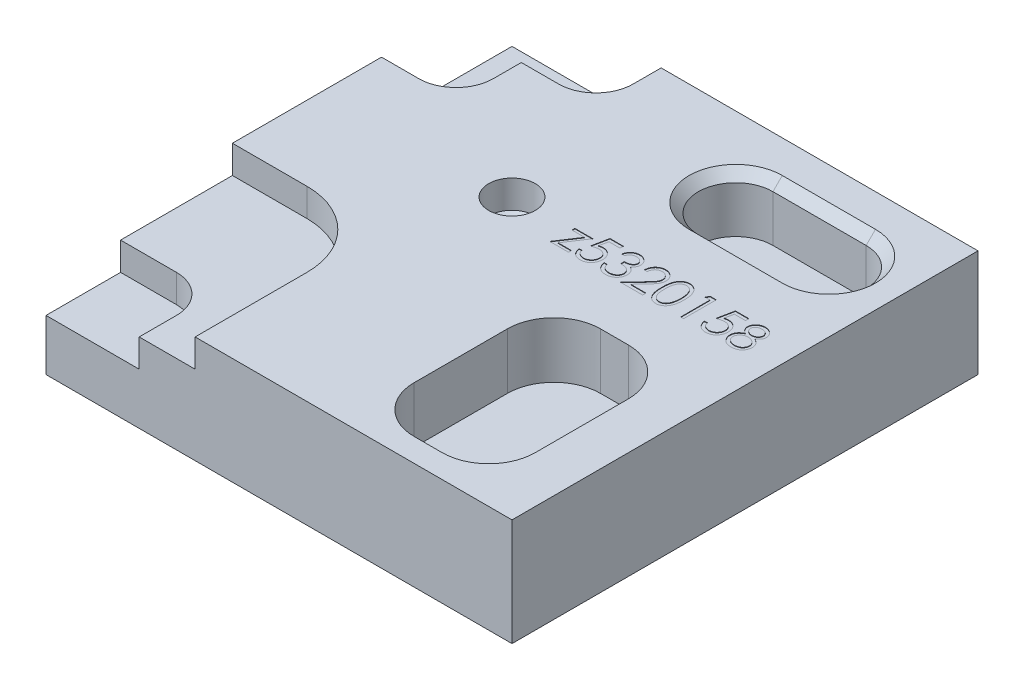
from build123d import *

# Parameters (mm, degrees)
SKETCH1_W                       = 50
SKETCH1_H                       = 50
BOSS_EXTRUDE1_DEPTH             = 11.5
CUT_EXTRUDE1_DEPTH              = 3
CUT_EXTRUDE4_DEPTH              = 43.99702731
CUT_EXTRUDE4_DEPTH_BACK         = 3
CUT_EXTRUDE5_DEPTH              = 6
CUT_EXTRUDE8_DEPTH              = 6
CUT_EXTRUDE11_DEPTH             = 44.689178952
CUT_EXTRUDE11_DEPTH_BACK        = 6
CHAMFER1_SIZE                   = 1
F_3_0MM_DOWEL_HOLE1_D           = 3
F_3_0MM_DOWEL_HOLE1_DEPTH       = 6
F_3_0MM_DOWEL_HOLE1_CSINK_D     = 3.05
F_3_0MM_DOWEL_HOLE1_CSINK_ANGLE = 90
F_3_0MM_DOWEL_HOLE1_TIP         = 0.901290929
F_5_0MM_DOWEL_HOLE1_D           = 5
F_5_0MM_DOWEL_HOLE1_DEPTH       = 3
F_5_0MM_DOWEL_HOLE1_TIP         = 1.502151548
ENGRAVE_CUT_DEPTH               = 0.05


with BuildPart() as part:
    # Sketch1 → Boss-Extrude1 (new body)
    with BuildSketch(Plane(origin=(0, 0, 0), x_dir=(1, 0, 0), z_dir=(0, 1, 0))):
        with Locations((4.357016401, -5.243345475)):
            Rectangle(SKETCH1_W, SKETCH1_H)
    extrude(amount=BOSS_EXTRUDE1_DEPTH)

    # Sketch3 → Cut-Extrude1 (cut)
    with BuildSketch(Plane(origin=(0, 11.5, 0), x_dir=(1, 0, 0), z_dir=(0, 1, 0))):
        with BuildLine():
            Line((-20.642983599, -10.243345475), (-12.642983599, -10.243345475))
            ThreePointArc((-12.642983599, -10.243345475), (-6.986129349, -12.586491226), (-4.642983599, -18.243345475))
            Line((-4.642983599, -18.243345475), (-4.642983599, -30.243345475))
            Line((-4.642983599, -30.243345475), (-20.642983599, -30.243345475))
            Line((-20.642983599, -30.243345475), (-20.642983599, -10.243345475))
        make_face()
    extrude(amount=-CUT_EXTRUDE1_DEPTH, mode=Mode.SUBTRACT)

    # Sketch7 → Cut-Extrude4 (cut, two sides: drawn at the far end of the back side and taken through both)
    with BuildSketch(Plane(origin=(0, 8.5, 0), x_dir=(1, 0, 0), z_dir=(0, 1, 0)).offset(-CUT_EXTRUDE4_DEPTH_BACK)):
        with BuildLine():
            Line((-161.241605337, -22.243345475), (-20.642983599, -22.243345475))
            Line((-20.642983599, -22.243345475), (-14.642983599, -22.243345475))
            ThreePointArc((-14.642983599, -22.243345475), (-11.814556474, -23.41491835), (-10.642983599, -26.243345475))
            Line((-10.642983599, -26.243345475), (-10.642983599, -30.243345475))
            Line((-10.642983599, -30.243345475), (-10.642983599, -170.841967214))
            Line((-10.642983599, -170.841967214), (-208.145915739, -371.003106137))
            Line((-208.145915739, -371.003106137), (-358.744537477, -222.404484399))
            Line((-358.744537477, -222.404484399), (-161.241605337, -22.243345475))
        make_face()
    extrude(amount=CUT_EXTRUDE4_DEPTH + CUT_EXTRUDE4_DEPTH_BACK, mode=Mode.SUBTRACT)

    # Sketch8 → Cut-Extrude5 (cut)
    with BuildSketch(Plane(origin=(0, 11.5, 0), x_dir=(1, 0, 0), z_dir=(0, 1, 0))):
        with BuildLine():
            Line((16.357016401, -7.743345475), (19.357016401, -7.743345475))
            ThreePointArc((19.357016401, -7.743345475), (22.892550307, -9.207811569), (24.357016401, -12.743345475))
            Line((24.357016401, -12.743345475), (24.357016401, -22.743345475))
            ThreePointArc((24.357016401, -22.743345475), (22.892550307, -26.278879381), (19.357016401, -27.743345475))
            Line((19.357016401, -27.743345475), (16.357016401, -27.743345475))
            ThreePointArc((16.357016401, -27.743345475), (12.821482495, -26.278879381), (11.357016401, -22.743345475))
            Line((11.357016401, -22.743345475), (11.357016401, -12.743345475))
            ThreePointArc((11.357016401, -12.743345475), (12.821482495, -9.207811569), (16.357016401, -7.743345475))
        make_face()
    extrude(amount=-CUT_EXTRUDE5_DEPTH, mode=Mode.SUBTRACT)

    # Sketch11 → Cut-Extrude8 (cut)
    with BuildSketch(Plane(origin=(0, 11.5, 0), x_dir=(1, 0, 0), z_dir=(0, 1, 0))):
        with BuildLine():
            Line((11.857016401, 15.256654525), (21.857016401, 15.256654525))
            ThreePointArc((21.857016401, 15.256654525), (25.857016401, 11.256654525), (21.857016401, 7.256654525))
            Line((21.857016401, 7.256654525), (11.857016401, 7.256654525))
            ThreePointArc((11.857016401, 7.256654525), (7.857016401, 11.256654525), (11.857016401, 15.256654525))
        make_face()
    extrude(amount=-CUT_EXTRUDE8_DEPTH, mode=Mode.SUBTRACT)

    # Sketch12 → Cut-Extrude11 (cut, two sides: drawn at the far end of the back side and taken through both)
    with BuildSketch(Plane(origin=(0, 11.5, 0), x_dir=(1, 0, 0), z_dir=(0, 1, 0)).offset(-CUT_EXTRUDE11_DEPTH_BACK)):
        with BuildLine():
            Line((-153.866358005, 5.756654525), (-20.642983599, 5.756654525))
            Line((-20.642983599, 5.756654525), (-16.642983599, 5.756654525))
            ThreePointArc((-16.642983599, 5.756654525), (-13.814556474, 6.9282274), (-12.642983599, 9.756654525))
            Line((-12.642983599, 9.756654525), (-12.642983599, 12.756654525))
            Line((-12.642983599, 12.756654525), (-8.642983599, 12.756654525))
            ThreePointArc((-8.642983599, 12.756654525), (-5.814556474, 13.9282274), (-4.642983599, 16.756654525))
            Line((-4.642983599, 16.756654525), (-4.642983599, 19.756654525))
            Line((-4.642983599, 19.756654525), (-4.642983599, 152.980028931))
            Line((-4.642983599, 152.980028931), (-191.773930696, 342.653112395))
            Line((-191.773930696, 342.653112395), (-340.997305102, 195.429737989))
            Line((-340.997305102, 195.429737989), (-153.866358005, 5.756654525))
        make_face()
    extrude(amount=CUT_EXTRUDE11_DEPTH + CUT_EXTRUDE11_DEPTH_BACK, mode=Mode.SUBTRACT)

    # Chamfer1
    chamfer1_edges = [part.edges().sort_by_distance(p)[0] for p in [
        (7.857016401, 11.5, -11.256654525),
        (16.857016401, 11.5, -7.256654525),
        (25.857016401, 11.5, -11.256654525),
        (16.857016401, 11.5, -15.256654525),
    ]]
    chamfer(chamfer1_edges, length=CHAMFER1_SIZE)

    # 3.0mm Dowel Hole1
    with Locations(Plane(origin=(-0.642983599, 11.5, 0.243345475), x_dir=(0, 0, 1), z_dir=(0, 1, 0))):
        with Locations((0, 0)):
            CounterSinkHole(F_3_0MM_DOWEL_HOLE1_D / 2, F_3_0MM_DOWEL_HOLE1_CSINK_D / 2, depth=F_3_0MM_DOWEL_HOLE1_DEPTH, counter_sink_angle=F_3_0MM_DOWEL_HOLE1_CSINK_ANGLE)
            with Locations((0, 0, -(F_3_0MM_DOWEL_HOLE1_DEPTH + F_3_0MM_DOWEL_HOLE1_TIP / 2))):  # 118° drill point
                Cone(0, F_3_0MM_DOWEL_HOLE1_D / 2, F_3_0MM_DOWEL_HOLE1_TIP, mode=Mode.SUBTRACT)

    # 5.0mm Dowel Hole1
    with Locations(Plane(origin=(-0.642983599, 11.5, 0.243345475), x_dir=(0, 0, 1), z_dir=(0, 1, 0))):
        with Locations((0, 0)):
            Hole(F_5_0MM_DOWEL_HOLE1_D / 2, depth=F_5_0MM_DOWEL_HOLE1_DEPTH)
            with Locations((0, 0, -(F_5_0MM_DOWEL_HOLE1_DEPTH + F_5_0MM_DOWEL_HOLE1_TIP / 2))):  # 118° drill point
                Cone(0, F_5_0MM_DOWEL_HOLE1_D / 2, F_5_0MM_DOWEL_HOLE1_TIP, mode=Mode.SUBTRACT)

    # Engrave → Engrave cut (cut)
    # profile 1 of 8: a face of its own
    with BuildSketch(Plane(origin=(0, 11.5, 0), x_dir=(1, 0, 0), z_dir=(0, 1, 0))):
        Polygon((5.641411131, 0.217706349), (7.570898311, 0.217706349), (6.083117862, -2.025883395), (7.526026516, -2.025883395), (7.526026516, -2.339985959), (5.506795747, -2.339985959), (6.995277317, -0.096396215), (5.641411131, -0.096396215), align=None)
    # profile 2 of 8: a face of its own
    with BuildSketch(Plane(origin=(0, 11.5, 0), x_dir=(1, 0, 0), z_dir=(0, 1, 0))):
        with BuildLine():
            Line((9.904231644, 1.160014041), (9.904231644, 0.801039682))
            Line((9.904231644, 0.801039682), (8.713726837, 0.801039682))
            Line((8.713726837, 0.801039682), (8.525125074, -0.119533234))
            add(Edge.make_bspline(
                [(8.525125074, -0.119533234), (8.562180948, -0.109302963), (8.633970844, -0.089483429), (8.739930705, -0.067477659), (8.840522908, -0.054212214), (8.905798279, -0.052400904), (8.937384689, -0.05152442)],
                knots=[0, 0, 0, 0, 1.100273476, 2.13160584, 3.095893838, 4, 4, 4, 4], degree=3))
            add(Edge.make_bspline(
                [(8.937384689, -0.05152442), (8.976468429, -0.052370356), (9.053316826, -0.054033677), (9.165755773, -0.070005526), (9.273088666, -0.095145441), (9.375091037, -0.130265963), (9.471951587, -0.175175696), (9.562779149, -0.231275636), (9.648937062, -0.296808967), (9.728879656, -0.372153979), (9.801403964, -0.455075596), (9.865169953, -0.544233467), (9.919332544, -0.638761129), (9.962893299, -0.739561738), (9.997677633, -0.845520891), (10.020829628, -0.957753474), (10.036246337, -1.075201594), (10.037968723, -1.155506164), (10.038847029, -1.196456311)],
                knots=[0, 0, 0, 0, 1.052922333, 2.070308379, 3.05430497, 4.020497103, 4.973039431, 5.925935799, 6.892292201, 7.88610001, 8.88166317, 9.857072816, 10.836096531, 11.812156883, 12.81219415, 13.836441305, 14.89672472, 16, 16, 16, 16], degree=3))
            add(Edge.make_bspline(
                [(10.038847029, -1.196456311), (10.038181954, -1.224978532), (10.036860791, -1.281637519), (10.030142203, -1.36578172), (10.017206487, -1.448144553), (9.999838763, -1.528736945), (9.977296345, -1.607406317), (9.950007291, -1.684377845), (9.916611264, -1.759172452), (9.879979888, -1.832497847), (9.83873341, -1.902696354), (9.792954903, -1.96834534), (9.744589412, -2.030429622), (9.692548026, -2.088283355), (9.636347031, -2.141526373), (9.576667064, -2.190474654), (9.513984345, -2.235955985), (9.447329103, -2.27612418), (9.37818662, -2.313087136), (9.305558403, -2.343410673), (9.231097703, -2.370521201), (9.153732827, -2.392130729), (9.073639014, -2.409063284), (8.990684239, -2.420563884), (8.905303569, -2.428940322), (8.847428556, -2.429464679), (8.818193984, -2.429729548)],
                knots=[0, 0, 0, 0, 1.056347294, 2.098418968, 3.122841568, 4.141288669, 5.149314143, 6.15115421, 7.162517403, 8.180376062, 9.185164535, 10.17417709, 11.141909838, 12.097768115, 13.052685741, 14.0056014, 14.954263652, 15.917497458, 16.885230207, 17.854509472, 18.828990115, 19.81800267, 20.826176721, 21.857883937, 22.917946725, 24, 24, 24, 24], degree=3))
            add(Edge.make_bspline(
                [(8.818193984, -2.429729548), (8.783319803, -2.429038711), (8.714708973, -2.427679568), (8.614188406, -2.413461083), (8.5174738, -2.393097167), (8.425343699, -2.362460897), (8.336972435, -2.324073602), (8.253549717, -2.275557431), (8.172943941, -2.220578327), (8.098431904, -2.155697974), (8.029275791, -2.084782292), (7.967369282, -2.007824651), (7.912235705, -1.926095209), (7.864757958, -1.839197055), (7.824259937, -1.747358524), (7.792444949, -1.650235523), (7.766766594, -1.548335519), (7.755903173, -1.478182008), (7.75038549, -1.442550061)],
                knots=[0, 0, 0, 0, 1.0467383, 2.05933395, 3.04377827, 4.011590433, 4.970194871, 5.932262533, 6.905835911, 7.896367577, 8.894135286, 9.877477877, 10.858688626, 11.851381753, 12.8477658, 13.868841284, 14.917554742, 16, 16, 16, 16], degree=3))
            Line((7.75038549, -1.442550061), (8.064488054, -1.442550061))
            add(Edge.make_bspline(
                [(8.064488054, -1.442550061), (8.072216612, -1.475926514), (8.087071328, -1.540077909), (8.119677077, -1.63020925), (8.159542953, -1.710528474), (8.206947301, -1.782098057), (8.263497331, -1.844507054), (8.32802676, -1.900124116), (8.400374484, -1.950299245), (8.480767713, -1.992122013), (8.565580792, -2.027790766), (8.654348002, -2.051542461), (8.744652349, -2.068243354), (8.805730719, -2.069915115), (8.836423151, -2.07075519)],
                knots=[0, 0, 0, 0, 1.136247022, 2.183929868, 3.172523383, 4.106158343, 5.02341133, 5.958108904, 6.928429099, 7.938127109, 8.96079061, 9.975095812, 10.982467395, 12, 12, 12, 12], degree=3))
            add(Edge.make_bspline(
                [(8.836423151, -2.07075519), (8.866381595, -2.069934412), (8.925370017, -2.068318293), (9.012181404, -2.055879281), (9.095994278, -2.03672171), (9.175981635, -2.008051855), (9.253543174, -1.973207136), (9.326716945, -1.928492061), (9.397619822, -1.877032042), (9.464047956, -1.818075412), (9.524887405, -1.753105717), (9.578643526, -1.683628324), (9.623420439, -1.609511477), (9.661154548, -1.532038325), (9.689807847, -1.450359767), (9.710248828, -1.364858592), (9.722251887, -1.275323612), (9.723903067, -1.214254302), (9.724744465, -1.183134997)],
                knots=[0, 0, 0, 0, 1.027316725, 2.022795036, 3.002884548, 3.971462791, 4.93288096, 5.914575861, 6.907176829, 7.935150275, 8.956128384, 9.956726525, 10.942570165, 11.921478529, 12.907843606, 13.90538589, 14.932640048, 16, 16, 16, 16], degree=3))
            add(Edge.make_bspline(
                [(9.724744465, -1.183134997), (9.724085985, -1.155059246), (9.722797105, -1.100104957), (9.712266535, -1.01970575), (9.693949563, -0.943632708), (9.668525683, -0.871518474), (9.636246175, -0.803295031), (9.596799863, -0.738891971), (9.549446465, -0.679158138), (9.495354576, -0.624065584), (9.436096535, -0.57322071), (9.370652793, -0.529876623), (9.300392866, -0.493412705), (9.226163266, -0.461944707), (9.146198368, -0.439343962), (9.062081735, -0.422376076), (8.972905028, -0.412560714), (8.911934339, -0.411198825), (8.880593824, -0.410498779)],
                knots=[0, 0, 0, 0, 1.045622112, 2.046656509, 3.013763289, 3.955457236, 4.890082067, 5.820317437, 6.762574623, 7.722996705, 8.69280354, 9.665887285, 10.63943826, 11.638615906, 12.663482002, 13.728887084, 14.832589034, 16, 16, 16, 16], degree=3))
            add(Edge.make_bspline(
                [(8.880593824, -0.410498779), (8.853464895, -0.41107937), (8.79745054, -0.412278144), (8.711527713, -0.421104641), (8.62123599, -0.435343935), (8.526921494, -0.454930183), (8.428300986, -0.480561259), (8.325582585, -0.51127576), (8.218550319, -0.547997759), (8.146432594, -0.575729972), (8.109359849, -0.589985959)],
                knots=[0, 0, 0, 0, 0.817624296, 1.688186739, 2.600797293, 3.572016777, 4.590301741, 5.671205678, 6.80286297, 8, 8, 8, 8], degree=3))
            Line((8.109359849, -0.589985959), (8.468334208, 1.160014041))
            Line((8.468334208, 1.160014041), (9.904231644, 1.160014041))
        make_face()
    # profile 3 of 8: a face of its own
    with BuildSketch(Plane(origin=(0, 11.5, 0), x_dir=(1, 0, 0), z_dir=(0, 1, 0))):
        with BuildLine():
            Line((10.846539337, 0.352321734), (10.532436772, 0.352321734))
            add(Edge.make_bspline(
                [(10.532436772, 0.352321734), (10.540946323, 0.387554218), (10.557581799, 0.456430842), (10.592279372, 0.554838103), (10.630078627, 0.647961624), (10.675467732, 0.734057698), (10.724976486, 0.814856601), (10.781699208, 0.888525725), (10.84301893, 0.956938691), (10.91084388, 1.017651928), (10.981972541, 1.072629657), (11.057407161, 1.119504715), (11.135630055, 1.159828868), (11.217183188, 1.193049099), (11.302309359, 1.218074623), (11.390238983, 1.236231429), (11.481202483, 1.248022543), (11.542950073, 1.249173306), (11.57430376, 1.249757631)],
                knots=[0, 0, 0, 0, 1.162005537, 2.271625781, 3.343758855, 4.383309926, 5.390229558, 6.379919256, 7.361854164, 8.333198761, 9.295911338, 10.242430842, 11.177959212, 12.116337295, 13.062827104, 14.020064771, 14.994644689, 16, 16, 16, 16], degree=3))
            add(Edge.make_bspline(
                [(11.57430376, 1.249757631), (11.619986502, 1.248378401), (11.710355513, 1.245650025), (11.84311856, 1.220735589), (11.971145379, 1.181310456), (12.093034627, 1.126836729), (12.206253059, 1.059649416), (12.306989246, 0.979684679), (12.393877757, 0.888485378), (12.466772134, 0.787752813), (12.523847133, 0.680097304), (12.565933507, 0.569297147), (12.591555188, 0.455615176), (12.594875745, 0.378857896), (12.596539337, 0.340402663)],
                knots=[0, 0, 0, 0, 1.083050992, 2.142477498, 3.193116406, 4.255571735, 5.30263384, 6.308962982, 7.297363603, 8.282367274, 9.249857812, 10.179914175, 11.08814088, 12, 12, 12, 12], degree=3))
            add(Edge.make_bspline(
                [(12.596539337, 0.340402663), (12.595375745, 0.303395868), (12.593098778, 0.230979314), (12.573765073, 0.125257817), (12.54122881, 0.025616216), (12.496159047, -0.068364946), (12.437817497, -0.156089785), (12.3671448, -0.237755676), (12.283642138, -0.313724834), (12.2203632, -0.357244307), (12.18778533, -0.37964942)],
                knots=[0, 0, 0, 0, 1.024540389, 2.004866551, 2.965041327, 3.920577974, 4.882998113, 5.874504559, 6.905732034, 8, 8, 8, 8], degree=3))
            add(Edge.make_bspline(
                [(12.18778533, -0.37964942), (12.225017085, -0.397627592), (12.298783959, -0.433247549), (12.399334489, -0.503103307), (12.490612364, -0.583759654), (12.541516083, -0.646702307), (12.567092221, -0.678327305)],
                knots=[0, 0, 0, 0, 1.015518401, 2.012035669, 3.001164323, 4, 4, 4, 4], degree=3))
            add(Edge.make_bspline(
                [(12.567092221, -0.678327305), (12.583933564, -0.701385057), (12.61734046, -0.747122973), (12.658575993, -0.820659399), (12.695985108, -0.895010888), (12.725135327, -0.972170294), (12.747709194, -1.051243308), (12.763845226, -1.132365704), (12.773869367, -1.215603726), (12.775304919, -1.271916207), (12.776026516, -1.300222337)],
                knots=[0, 0, 0, 0, 1.025084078, 2.033381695, 3.024893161, 4.013698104, 4.991890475, 5.976764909, 6.982997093, 8, 8, 8, 8], degree=3))
            add(Edge.make_bspline(
                [(12.776026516, -1.300222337), (12.774232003, -1.349232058), (12.77065142, -1.44702086), (12.738647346, -1.591495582), (12.689034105, -1.732721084), (12.61857717, -1.867795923), (12.532709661, -1.994176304), (12.430552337, -2.107252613), (12.313265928, -2.204451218), (12.182460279, -2.285661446), (12.040743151, -2.350579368), (11.889167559, -2.395636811), (11.729917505, -2.42498281), (11.620710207, -2.428129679), (11.565189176, -2.429729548)],
                knots=[0, 0, 0, 0, 0.955779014, 1.907060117, 2.875433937, 3.871313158, 4.872415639, 5.851225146, 6.836215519, 7.83643374, 8.849228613, 9.86973379, 10.916971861, 12, 12, 12, 12], degree=3))
            add(Edge.make_bspline(
                [(11.565189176, -2.429729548), (11.527769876, -2.428861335), (11.454141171, -2.427152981), (11.345897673, -2.41547438), (11.242575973, -2.394144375), (11.144036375, -2.365441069), (11.050191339, -2.329049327), (10.961327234, -2.283730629), (10.87689734, -2.230419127), (10.797698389, -2.168485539), (10.723739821, -2.0992042), (10.656987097, -2.02134519), (10.596327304, -1.936347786), (10.543384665, -1.843224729), (10.495747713, -1.743179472), (10.456566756, -1.634930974), (10.422081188, -1.519446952), (10.406047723, -1.438969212), (10.397821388, -1.397678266)],
                knots=[0, 0, 0, 0, 1.048658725, 2.063410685, 3.046034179, 4.001477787, 4.936774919, 5.862367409, 6.792675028, 7.730719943, 8.675894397, 9.627829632, 10.600096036, 11.597688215, 12.626045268, 13.701542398, 14.82072376, 16, 16, 16, 16], degree=3))
            Line((10.397821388, -1.397678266), (10.711923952, -1.397678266))
            add(Edge.make_bspline(
                [(10.711923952, -1.397678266), (10.720107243, -1.42462728), (10.736024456, -1.477045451), (10.763118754, -1.552485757), (10.793987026, -1.62164381), (10.827101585, -1.685026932), (10.861880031, -1.743259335), (10.900794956, -1.794801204), (10.940964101, -1.841916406), (10.971243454, -1.868461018), (10.986062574, -1.881452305)],
                knots=[0, 0, 0, 0, 1.198163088, 2.33053128, 3.407730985, 4.417276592, 5.372219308, 6.28897303, 7.162600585, 8, 8, 8, 8], degree=3))
            add(Edge.make_bspline(
                [(10.986062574, -1.881452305), (11.00565915, -1.896560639), (11.044791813, -1.926730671), (11.108560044, -1.965232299), (11.17562493, -1.998593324), (11.247439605, -2.02407702), (11.322454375, -2.045654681), (11.40188174, -2.0597752), (11.485020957, -2.069463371), (11.541788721, -2.070318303), (11.570798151, -2.07075519)],
                knots=[0, 0, 0, 0, 0.946170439, 1.889420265, 2.845303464, 3.807233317, 4.801018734, 5.828864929, 6.890507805, 8, 8, 8, 8], degree=3))
            add(Edge.make_bspline(
                [(11.570798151, -2.07075519), (11.603551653, -2.070139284), (11.6675983, -2.068934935), (11.76105316, -2.057859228), (11.849960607, -2.041728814), (11.933333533, -2.016815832), (12.01226404, -1.98603498), (12.08564569, -1.947386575), (12.154441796, -1.902041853), (12.217771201, -1.850502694), (12.274716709, -1.794081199), (12.324856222, -1.735068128), (12.367480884, -1.673712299), (12.401864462, -1.609674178), (12.429015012, -1.543218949), (12.447498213, -1.47416012), (12.460349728, -1.403062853), (12.46139634, -1.354733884), (12.461923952, -1.330370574)],
                knots=[0, 0, 0, 0, 1.217147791, 2.380027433, 3.494444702, 4.572153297, 5.609568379, 6.639424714, 7.649109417, 8.668170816, 9.669597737, 10.625200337, 11.543417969, 12.441394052, 13.322311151, 14.205496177, 15.095365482, 16, 16, 16, 16], degree=3))
            add(Edge.make_bspline(
                [(12.461923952, -1.330370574), (12.46039365, -1.297759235), (12.457340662, -1.232698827), (12.434032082, -1.136981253), (12.395693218, -1.04475784), (12.342020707, -0.95760205), (12.276684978, -0.876826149), (12.200320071, -0.804754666), (12.112291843, -0.745284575), (12.031271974, -0.704195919), (11.959506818, -0.676158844), (11.898091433, -0.657483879), (11.82933483, -0.641670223), (11.754068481, -0.626957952), (11.671725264, -0.614436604), (11.582394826, -0.603994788), (11.486059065, -0.595639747), (11.419367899, -0.591908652), (11.385000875, -0.589985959)],
                knots=[0, 0, 0, 0, 1.07054697, 2.135767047, 3.216561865, 4.33974944, 5.486079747, 6.621378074, 7.775625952, 8.963672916, 9.598146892, 10.304877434, 11.070270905, 11.915000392, 12.823868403, 13.805723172, 14.86925407, 16, 16, 16, 16], degree=3))
            Line((11.385000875, -0.589985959), (11.385000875, -0.2310116))
            add(Edge.make_bspline(
                [(11.385000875, -0.2310116), (11.428302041, -0.230276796), (11.513118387, -0.228837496), (11.637012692, -0.211429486), (11.755486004, -0.187348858), (11.865912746, -0.150463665), (11.96656146, -0.107623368), (12.053881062, -0.057771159), (12.126648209, -0.00235641), (12.18450928, 0.0594762), (12.228038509, 0.125791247), (12.259865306, 0.194907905), (12.278665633, 0.267431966), (12.2811753, 0.316926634), (12.282436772, 0.341804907)],
                knots=[0, 0, 0, 0, 1.321986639, 2.589447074, 3.816329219, 5.01088745, 6.139805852, 7.153945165, 8.075214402, 8.924034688, 9.728124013, 10.488707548, 11.240355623, 12, 12, 12, 12], degree=3))
            add(Edge.make_bspline(
                [(12.282436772, 0.341804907), (12.282022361, 0.360082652), (12.281197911, 0.396445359), (12.270800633, 0.449570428), (12.255176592, 0.501071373), (12.233696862, 0.550729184), (12.204946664, 0.598199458), (12.170540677, 0.643886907), (12.129572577, 0.687530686), (12.08262713, 0.728211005), (12.032215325, 0.766980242), (11.97696555, 0.799893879), (11.918543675, 0.828038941), (11.85688502, 0.851248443), (11.79178949, 0.868707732), (11.723562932, 0.881243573), (11.652075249, 0.889081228), (11.603303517, 0.890209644), (11.57851049, 0.890783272)],
                knots=[0, 0, 0, 0, 0.884392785, 1.759457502, 2.611959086, 3.489218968, 4.37281399, 5.2945488, 6.255912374, 7.266815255, 8.301784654, 9.332968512, 10.37626691, 11.440494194, 12.520033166, 13.637162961, 14.798855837, 16, 16, 16, 16], degree=3))
            add(Edge.make_bspline(
                [(11.57851049, 0.890783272), (11.538658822, 0.88939191), (11.460819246, 0.886674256), (11.348604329, 0.862871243), (11.244284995, 0.824893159), (11.164546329, 0.77956014), (11.105663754, 0.734809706), (11.063586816, 0.69572732), (11.022266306, 0.652294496), (10.984420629, 0.601836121), (10.946146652, 0.547769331), (10.911302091, 0.487345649), (10.877442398, 0.422141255), (10.857039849, 0.37604562), (10.846539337, 0.352321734)],
                knots=[0, 0, 0, 0, 1.472543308, 2.876219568, 4.221790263, 5.565193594, 6.249813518, 6.953379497, 7.687249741, 8.463570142, 9.283606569, 10.136032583, 11.040678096, 12, 12, 12, 12], degree=3))
        make_face()
    # profile 4 of 8: a face of its own
    with BuildSketch(Plane(origin=(0, 11.5, 0), x_dir=(1, 0, 0), z_dir=(0, 1, 0))):
        with BuildLine():
            Line((13.538847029, 0.083090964), (13.224744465, 0.083090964))
            add(Edge.make_bspline(
                [(13.224744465, 0.083090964), (13.226791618, 0.124761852), (13.230812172, 0.206602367), (13.249640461, 0.325926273), (13.276581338, 0.439981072), (13.314672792, 0.547850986), (13.36197907, 0.650489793), (13.418709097, 0.747489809), (13.485902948, 0.838480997), (13.562109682, 0.922619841), (13.644878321, 0.999807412), (13.73418426, 1.066462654), (13.828029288, 1.122780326), (13.926128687, 1.169861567), (14.02958925, 1.205201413), (14.137472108, 1.231423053), (14.250251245, 1.247199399), (14.327091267, 1.248895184), (14.366170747, 1.249757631)],
                knots=[0, 0, 0, 0, 1.10065271, 2.161652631, 3.183658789, 4.190468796, 5.17591951, 6.163126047, 7.15150782, 8.156236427, 9.156009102, 10.134482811, 11.092018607, 12.041330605, 13.001268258, 13.972401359, 14.968799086, 16, 16, 16, 16], degree=3))
            add(Edge.make_bspline(
                [(14.366170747, 1.249757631), (14.404548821, 1.248859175), (14.479960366, 1.24709374), (14.59002238, 1.23193271), (14.694799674, 1.208187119), (14.794087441, 1.174871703), (14.887093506, 1.130087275), (14.97451655, 1.076289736), (15.057397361, 1.014069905), (15.132004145, 0.940816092), (15.200512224, 0.862613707), (15.259614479, 0.779125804), (15.310227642, 0.692896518), (15.352415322, 0.603268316), (15.383471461, 0.509397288), (15.407049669, 0.412650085), (15.420377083, 0.312025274), (15.422422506, 0.243918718), (15.423462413, 0.209292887)],
                knots=[0, 0, 0, 0, 1.111607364, 2.184268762, 3.212621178, 4.221274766, 5.211760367, 6.196651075, 7.1921475, 8.207485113, 9.220403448, 10.201281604, 11.166441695, 12.114753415, 13.065576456, 14.026450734, 14.996634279, 16, 16, 16, 16], degree=3))
            add(Edge.make_bspline(
                [(15.423462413, 0.209292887), (15.421769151, 0.160545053), (15.418412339, 0.063904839), (15.389697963, -0.078110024), (15.344851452, -0.215703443), (15.290854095, -0.326440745), (15.236381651, -0.415674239), (15.187294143, -0.489142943), (15.129829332, -0.568248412), (15.063150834, -0.652725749), (14.988637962, -0.743236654), (14.905615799, -0.83972645), (14.813492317, -0.94119822), (14.748833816, -1.010503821), (14.715329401, -1.046416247)],
                knots=[0, 0, 0, 0, 1.184426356, 2.348067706, 3.509069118, 4.696110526, 5.333549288, 6.050745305, 6.844228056, 7.710549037, 8.667450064, 9.695053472, 10.805634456, 12, 12, 12, 12], degree=3))
            Line((14.715329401, -1.046416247), (13.839628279, -1.9810116))
            Line((13.839628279, -1.9810116), (15.468334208, -1.9810116))
            Line((15.468334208, -1.9810116), (15.468334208, -2.339985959))
            Line((15.468334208, -2.339985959), (13.09012908, -2.339985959))
            Line((13.09012908, -2.339985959), (14.447500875, -0.891468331))
            add(Edge.make_bspline(
                [(14.447500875, -0.891468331), (14.480548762, -0.856970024), (14.544026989, -0.790705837), (14.633809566, -0.693962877), (14.714448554, -0.604213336), (14.786465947, -0.521626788), (14.848299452, -0.44499522), (14.903171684, -0.376800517), (14.947137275, -0.314046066), (14.994852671, -0.241305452), (15.041066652, -0.152493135), (15.080779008, -0.043959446), (15.104993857, 0.067767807), (15.107898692, 0.143269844), (15.109359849, 0.181248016)],
                knots=[0, 0, 0, 0, 1.329631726, 2.553950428, 3.673215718, 4.687767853, 5.603093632, 6.413772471, 7.123043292, 7.734684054, 8.834405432, 9.900288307, 10.943827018, 12, 12, 12, 12], degree=3))
            add(Edge.make_bspline(
                [(15.109359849, 0.181248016), (15.108724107, 0.205129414), (15.107471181, 0.252195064), (15.096413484, 0.321200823), (15.079702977, 0.387765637), (15.055757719, 0.452094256), (15.024150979, 0.513539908), (14.985677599, 0.572177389), (14.941287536, 0.628866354), (14.889936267, 0.682019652), (14.833524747, 0.730700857), (14.773930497, 0.773824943), (14.710880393, 0.809864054), (14.644640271, 0.839407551), (14.575394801, 0.862582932), (14.503010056, 0.878641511), (14.42768604, 0.888723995), (14.376252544, 0.890088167), (14.350044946, 0.890783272)],
                knots=[0, 0, 0, 0, 0.991446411, 1.95395049, 2.89581595, 3.838931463, 4.798493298, 5.75982156, 6.748411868, 7.785213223, 8.824556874, 9.840280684, 10.836137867, 11.835679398, 12.848801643, 13.863922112, 14.911575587, 16, 16, 16, 16], degree=3))
            add(Edge.make_bspline(
                [(14.350044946, 0.890783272), (14.322674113, 0.89006824), (14.268922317, 0.888664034), (14.190003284, 0.87884137), (14.114717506, 0.86189553), (14.042875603, 0.838718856), (13.974356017, 0.809260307), (13.909491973, 0.772568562), (13.848429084, 0.728785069), (13.791052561, 0.679144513), (13.738188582, 0.623876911), (13.691741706, 0.562266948), (13.651157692, 0.495439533), (13.615748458, 0.423574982), (13.586992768, 0.346021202), (13.565019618, 0.263053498), (13.547632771, 0.175032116), (13.54182425, 0.114247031), (13.538847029, 0.083090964)],
                knots=[0, 0, 0, 0, 1.031018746, 2.02475058, 2.990194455, 3.934040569, 4.864654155, 5.795059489, 6.735614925, 7.690564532, 8.649604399, 9.611025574, 10.590972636, 11.591080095, 12.624614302, 13.701020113, 14.821632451, 16, 16, 16, 16], degree=3))
        make_face()
    # profile 5 of 8: a face of its own
    with BuildSketch(Plane(origin=(0, 11.5, 0), x_dir=(1, 0, 0), z_dir=(0, 1, 0))):
        with BuildLine():
            add(Edge.make_bspline(
                [(15.782436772, -0.591388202), (15.782764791, -0.535290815), (15.783401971, -0.42632083), (15.790490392, -0.267536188), (15.802265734, -0.118575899), (15.818403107, 0.020567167), (15.838041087, 0.149928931), (15.864256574, 0.269163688), (15.894069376, 0.378823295), (15.928621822, 0.479265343), (15.967609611, 0.571843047), (16.010043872, 0.658268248), (16.057608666, 0.73841018), (16.107585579, 0.813547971), (16.161997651, 0.882451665), (16.219296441, 0.946094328), (16.281718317, 1.003005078), (16.347141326, 1.054851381), (16.41615779, 1.100300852), (16.486800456, 1.140333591), (16.559555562, 1.174533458), (16.634621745, 1.201423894), (16.711324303, 1.223634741), (16.78993137, 1.238823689), (16.870572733, 1.248380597), (16.925004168, 1.249294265), (16.952609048, 1.249757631)],
                knots=[0, 0, 0, 0, 1.646270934, 3.197905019, 4.663502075, 6.030701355, 7.308322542, 8.50163776, 9.611534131, 10.641858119, 11.616356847, 12.558055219, 13.465016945, 14.349605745, 15.204443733, 16.039544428, 16.859896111, 17.680448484, 18.487036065, 19.28249412, 20.06191084, 20.843045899, 21.620316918, 22.403196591, 23.190181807, 24, 24, 24, 24], degree=3))
            add(Edge.make_bspline(
                [(16.952609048, 1.249757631), (16.980444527, 1.249269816), (17.035800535, 1.248299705), (17.117640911, 1.238975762), (17.197590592, 1.223504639), (17.275308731, 1.201583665), (17.351433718, 1.174387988), (17.425370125, 1.140300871), (17.497577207, 1.100622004), (17.566907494, 1.053998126), (17.63412211, 1.00201585), (17.697570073, 0.943253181), (17.757257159, 0.878303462), (17.813932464, 0.807861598), (17.865988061, 0.730576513), (17.915561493, 0.647792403), (17.959933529, 0.558061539), (18.002668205, 0.462881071), (18.039555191, 0.359617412), (18.072821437, 0.248852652), (18.099700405, 0.129278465), (18.122089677, 0.001522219), (18.139434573, -0.134885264), (18.152067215, -0.279651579), (18.158740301, -0.43287197), (18.159997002, -0.537629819), (18.160641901, -0.591388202)],
                knots=[0, 0, 0, 0, 0.810914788, 1.612654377, 2.396697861, 3.181598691, 3.963628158, 4.749916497, 5.551656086, 6.361998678, 7.18212741, 8.025565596, 8.878627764, 9.750805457, 10.657531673, 11.591944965, 12.560506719, 13.57287815, 14.630710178, 15.753379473, 16.941251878, 18.199788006, 19.531962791, 20.947069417, 22.433333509, 24, 24, 24, 24], degree=3))
            add(Edge.make_bspline(
                [(18.160641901, -0.591388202), (18.159990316, -0.64491211), (18.15872073, -0.749201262), (18.152142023, -0.901732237), (18.139183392, -1.045730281), (18.122973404, -1.181540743), (18.100522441, -1.308598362), (18.072917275, -1.427342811), (18.042266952, -1.538286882), (18.004432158, -1.640521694), (17.963021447, -1.735473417), (17.917966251, -1.824140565), (17.869696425, -1.907306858), (17.81710768, -1.984306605), (17.761054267, -2.055685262), (17.700336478, -2.120182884), (17.636665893, -2.179353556), (17.569253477, -2.232005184), (17.498841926, -2.278089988), (17.426882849, -2.319303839), (17.352099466, -2.352536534), (17.276186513, -2.381071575), (17.198058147, -2.402872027), (17.117811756, -2.417945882), (17.03585552, -2.428517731), (16.980453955, -2.429324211), (16.952609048, -2.429729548)],
                knots=[0, 0, 0, 0, 1.561518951, 3.042555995, 4.452378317, 5.7783523, 7.031515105, 8.214008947, 9.334062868, 10.386615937, 11.391082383, 12.354592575, 13.286541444, 14.194233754, 15.072674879, 15.931287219, 16.775624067, 17.606195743, 18.42308326, 19.229000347, 20.022332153, 20.807536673, 21.593273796, 22.3848459, 23.188221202, 24, 24, 24, 24], degree=3))
            add(Edge.make_bspline(
                [(16.952609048, -2.429729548), (16.925004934, -2.429263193), (16.870575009, -2.428343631), (16.789922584, -2.4188299), (16.71164014, -2.403534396), (16.635341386, -2.382117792), (16.560634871, -2.355902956), (16.488538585, -2.321749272), (16.418250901, -2.282415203), (16.349959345, -2.237619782), (16.284947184, -2.186298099), (16.222848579, -2.12953381), (16.16522356, -2.065910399), (16.111589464, -1.996432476), (16.060615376, -1.921739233), (16.013726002, -1.84081086), (15.970355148, -1.75396825), (15.930711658, -1.660650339), (15.895562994, -1.559495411), (15.864515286, -1.449346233), (15.840001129, -1.329230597), (15.819018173, -1.20011323), (15.80209379, -1.061439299), (15.790539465, -0.913133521), (15.78339815, -0.755288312), (15.782763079, -0.647018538), (15.782436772, -0.591388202)],
                knots=[0, 0, 0, 0, 0.810891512, 1.598919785, 2.382837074, 3.152667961, 3.926044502, 4.706494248, 5.493654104, 6.291793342, 7.103789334, 7.925228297, 8.761435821, 9.622817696, 10.50288917, 11.416980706, 12.369136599, 13.353924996, 14.394355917, 15.514179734, 16.714354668, 17.994756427, 19.357759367, 20.818452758, 22.365282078, 24, 24, 24, 24], degree=3))
        make_face()
        with BuildLine():
            add(Edge.make_bspline(
                [(16.096539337, -0.589985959), (16.096658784, -0.636734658), (16.096890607, -0.727464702), (16.102946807, -0.859307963), (16.111197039, -0.982278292), (16.121838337, -1.096531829), (16.137641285, -1.201681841), (16.155348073, -1.298451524), (16.176896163, -1.386328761), (16.202391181, -1.465916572), (16.231430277, -1.53856564), (16.263136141, -1.606166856), (16.297196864, -1.669518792), (16.335316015, -1.7280524), (16.376831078, -1.781958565), (16.420804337, -1.832191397), (16.468876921, -1.876988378), (16.535380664, -1.930715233), (16.623177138, -1.986234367), (16.733797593, -2.034580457), (16.847466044, -2.064962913), (16.924617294, -2.068826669), (16.963125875, -2.07075519)],
                knots=[0, 0, 0, 0, 1.459021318, 2.831673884, 4.118529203, 5.306027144, 6.411944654, 7.436330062, 8.375795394, 9.233974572, 10.042671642, 10.816086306, 11.563610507, 12.285937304, 12.993564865, 13.685989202, 14.367179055, 15.041617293, 16.353048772, 17.594441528, 18.799311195, 20, 20, 20, 20], degree=3))
            add(Edge.make_bspline(
                [(16.963125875, -2.07075519), (17.001883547, -2.069157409), (17.07931887, -2.065965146), (17.192452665, -2.035166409), (17.302282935, -1.988696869), (17.388354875, -1.933749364), (17.453837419, -1.881421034), (17.500754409, -1.836806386), (17.543816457, -1.786850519), (17.584658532, -1.732951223), (17.622117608, -1.674078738), (17.656180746, -1.610516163), (17.687264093, -1.542086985), (17.704973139, -1.494317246), (17.714027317, -1.469893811)],
                knots=[0, 0, 0, 0, 1.353760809, 2.704726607, 4.075137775, 5.516104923, 6.260822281, 7.007110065, 7.778089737, 8.566572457, 9.372053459, 10.217411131, 11.088608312, 12, 12, 12, 12], degree=3))
            add(Edge.make_bspline(
                [(17.714027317, -1.469893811), (17.724579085, -1.438664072), (17.746003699, -1.375254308), (17.773615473, -1.276890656), (17.795360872, -1.173687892), (17.814924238, -1.066262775), (17.828277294, -0.953823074), (17.839025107, -0.83671669), (17.845355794, -0.714855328), (17.846140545, -0.632060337), (17.846539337, -0.589985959)],
                knots=[0, 0, 0, 0, 0.884706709, 1.796334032, 2.740027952, 3.714592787, 4.726048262, 5.777819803, 6.87074269, 8, 8, 8, 8], degree=3))
            add(Edge.make_bspline(
                [(17.846539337, -0.589985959), (17.845989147, -0.547918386), (17.84491286, -0.465625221), (17.840798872, -0.345107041), (17.830175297, -0.23063928), (17.818376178, -0.121728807), (17.800978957, -0.018978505), (17.782221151, 0.078471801), (17.757019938, 0.169414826), (17.730100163, 0.255274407), (17.699289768, 0.335075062), (17.665374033, 0.409188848), (17.629152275, 0.477973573), (17.589810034, 0.541240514), (17.547814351, 0.599273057), (17.502056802, 0.650907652), (17.454352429, 0.69774462), (17.387535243, 0.751207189), (17.300060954, 0.805718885), (17.191215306, 0.855884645), (17.077944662, 0.884692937), (17.001371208, 0.888754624), (16.963125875, 0.890783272)],
                knots=[0, 0, 0, 0, 1.31362396, 2.569729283, 3.763502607, 4.902122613, 5.988968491, 7.01645872, 7.998833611, 8.933434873, 9.825090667, 10.667526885, 11.477055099, 12.250526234, 12.991942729, 13.710640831, 14.402115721, 15.076753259, 16.378508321, 17.609869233, 18.806226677, 20, 20, 20, 20], degree=3))
            add(Edge.make_bspline(
                [(16.963125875, 0.890783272), (16.924415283, 0.888751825), (16.846923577, 0.884685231), (16.732475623, 0.855991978), (16.622771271, 0.805979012), (16.535528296, 0.751026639), (16.46866451, 0.698688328), (16.421581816, 0.653301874), (16.377435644, 0.603655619), (16.336767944, 0.549253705), (16.298678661, 0.490788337), (16.263697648, 0.427799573), (16.232180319, 0.359968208), (16.203095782, 0.287351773), (16.177522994, 0.207770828), (16.156429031, 0.120001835), (16.136941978, 0.023539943), (16.123146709, -0.082179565), (16.110882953, -0.196461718), (16.103001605, -0.319739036), (16.096870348, -0.451803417), (16.096651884, -0.543002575), (16.096539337, -0.589985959)],
                knots=[0, 0, 0, 0, 1.207732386, 2.417664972, 3.655092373, 4.956220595, 5.625982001, 6.301752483, 6.994047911, 7.697131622, 8.419323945, 9.170223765, 9.943494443, 10.752040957, 11.610060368, 12.549350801, 13.567764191, 14.679664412, 15.874934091, 17.154273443, 18.533957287, 20, 20, 20, 20], degree=3))
        make_face(mode=Mode.SUBTRACT)
    # profile 6 of 8: a face of its own
    with BuildSketch(Plane(origin=(0, 11.5, 0), x_dir=(1, 0, 0), z_dir=(0, 1, 0))):
        Polygon((19.218634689, 1.160014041), (19.865770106, 1.160014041), (19.865770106, -2.339985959), (19.551667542, -2.339985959), (19.551667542, 0.801039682), (19.013206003, 0.801039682), align=None)
    # profile 7 of 8: a face of its own
    with BuildSketch(Plane(origin=(0, 11.5, 0), x_dir=(1, 0, 0), z_dir=(0, 1, 0))):
        with BuildLine():
            Line((23.365770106, 1.160014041), (23.365770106, 0.801039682))
            Line((23.365770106, 0.801039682), (22.175265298, 0.801039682))
            Line((22.175265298, 0.801039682), (21.986663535, -0.119533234))
            add(Edge.make_bspline(
                [(21.986663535, -0.119533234), (22.02371941, -0.109302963), (22.095509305, -0.089483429), (22.201469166, -0.067477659), (22.30206137, -0.054212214), (22.36733674, -0.052400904), (22.398923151, -0.05152442)],
                knots=[0, 0, 0, 0, 1.100273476, 2.13160584, 3.095893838, 4, 4, 4, 4], degree=3))
            add(Edge.make_bspline(
                [(22.398923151, -0.05152442), (22.43800689, -0.052370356), (22.514855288, -0.054033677), (22.627294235, -0.070005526), (22.734627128, -0.095145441), (22.836629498, -0.130265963), (22.933490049, -0.175175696), (23.02431761, -0.231275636), (23.110475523, -0.296808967), (23.190418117, -0.372153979), (23.262942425, -0.455075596), (23.326708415, -0.544233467), (23.380871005, -0.638761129), (23.42443176, -0.739561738), (23.459216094, -0.845520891), (23.482368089, -0.957753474), (23.497784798, -1.075201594), (23.499507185, -1.155506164), (23.50038549, -1.196456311)],
                knots=[0, 0, 0, 0, 1.052922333, 2.070308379, 3.05430497, 4.020497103, 4.973039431, 5.925935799, 6.892292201, 7.88610001, 8.88166317, 9.857072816, 10.836096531, 11.812156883, 12.81219415, 13.836441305, 14.89672472, 16, 16, 16, 16], degree=3))
            add(Edge.make_bspline(
                [(23.50038549, -1.196456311), (23.499720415, -1.224978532), (23.498399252, -1.281637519), (23.491680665, -1.36578172), (23.478744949, -1.448144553), (23.461377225, -1.528736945), (23.438834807, -1.607406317), (23.411545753, -1.684377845), (23.378149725, -1.759172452), (23.34151835, -1.832497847), (23.300271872, -1.902696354), (23.254493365, -1.96834534), (23.206127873, -2.030429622), (23.154086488, -2.088283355), (23.097885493, -2.141526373), (23.038205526, -2.190474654), (22.975522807, -2.235955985), (22.908867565, -2.27612418), (22.839725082, -2.313087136), (22.767096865, -2.343410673), (22.692636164, -2.370521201), (22.615271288, -2.392130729), (22.535177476, -2.409063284), (22.4522227, -2.420563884), (22.36684203, -2.428940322), (22.308967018, -2.429464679), (22.279732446, -2.429729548)],
                knots=[0, 0, 0, 0, 1.056347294, 2.098418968, 3.122841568, 4.141288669, 5.149314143, 6.15115421, 7.162517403, 8.180376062, 9.185164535, 10.17417709, 11.141909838, 12.097768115, 13.052685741, 14.0056014, 14.954263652, 15.917497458, 16.885230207, 17.854509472, 18.828990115, 19.81800267, 20.826176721, 21.857883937, 22.917946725, 24, 24, 24, 24], degree=3))
            add(Edge.make_bspline(
                [(22.279732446, -2.429729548), (22.244858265, -2.429038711), (22.176247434, -2.427679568), (22.075726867, -2.413461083), (21.979012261, -2.393097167), (21.88688216, -2.362460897), (21.798510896, -2.324073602), (21.715088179, -2.275557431), (21.634482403, -2.220578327), (21.559970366, -2.155697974), (21.490814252, -2.084782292), (21.428907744, -2.007824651), (21.373774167, -1.926095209), (21.32629642, -1.839197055), (21.285798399, -1.747358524), (21.25398341, -1.650235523), (21.228305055, -1.548335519), (21.217441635, -1.478182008), (21.211923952, -1.442550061)],
                knots=[0, 0, 0, 0, 1.0467383, 2.05933395, 3.04377827, 4.011590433, 4.970194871, 5.932262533, 6.905835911, 7.896367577, 8.894135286, 9.877477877, 10.858688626, 11.851381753, 12.8477658, 13.868841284, 14.917554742, 16, 16, 16, 16], degree=3))
            Line((21.211923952, -1.442550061), (21.526026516, -1.442550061))
            add(Edge.make_bspline(
                [(21.526026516, -1.442550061), (21.533755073, -1.475926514), (21.54860979, -1.540077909), (21.581215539, -1.63020925), (21.621081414, -1.710528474), (21.668485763, -1.782098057), (21.725035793, -1.844507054), (21.789565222, -1.900124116), (21.861912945, -1.950299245), (21.942306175, -1.992122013), (22.027119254, -2.027790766), (22.115886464, -2.051542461), (22.20619081, -2.068243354), (22.267269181, -2.069915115), (22.297961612, -2.07075519)],
                knots=[0, 0, 0, 0, 1.136247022, 2.183929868, 3.172523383, 4.106158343, 5.02341133, 5.958108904, 6.928429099, 7.938127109, 8.96079061, 9.975095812, 10.982467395, 12, 12, 12, 12], degree=3))
            add(Edge.make_bspline(
                [(22.297961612, -2.07075519), (22.327920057, -2.069934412), (22.386908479, -2.068318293), (22.473719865, -2.055879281), (22.55753274, -2.03672171), (22.637520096, -2.008051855), (22.715081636, -1.973207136), (22.788255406, -1.928492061), (22.859158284, -1.877032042), (22.925586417, -1.818075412), (22.986425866, -1.753105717), (23.040181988, -1.683628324), (23.084958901, -1.609511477), (23.12269301, -1.532038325), (23.151346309, -1.450359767), (23.17178729, -1.364858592), (23.183790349, -1.275323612), (23.185441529, -1.214254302), (23.186282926, -1.183134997)],
                knots=[0, 0, 0, 0, 1.027316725, 2.022795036, 3.002884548, 3.971462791, 4.93288096, 5.914575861, 6.907176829, 7.935150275, 8.956128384, 9.956726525, 10.942570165, 11.921478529, 12.907843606, 13.90538589, 14.932640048, 16, 16, 16, 16], degree=3))
            add(Edge.make_bspline(
                [(23.186282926, -1.183134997), (23.185624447, -1.155059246), (23.184335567, -1.100104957), (23.173804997, -1.01970575), (23.155488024, -0.943632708), (23.130064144, -0.871518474), (23.097784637, -0.803295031), (23.058338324, -0.738891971), (23.010984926, -0.679158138), (22.956893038, -0.624065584), (22.897634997, -0.57322071), (22.832191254, -0.529876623), (22.761931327, -0.493412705), (22.687701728, -0.461944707), (22.607736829, -0.439343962), (22.523620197, -0.422376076), (22.434443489, -0.412560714), (22.373472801, -0.411198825), (22.342132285, -0.410498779)],
                knots=[0, 0, 0, 0, 1.045622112, 2.046656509, 3.013763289, 3.955457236, 4.890082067, 5.820317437, 6.762574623, 7.722996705, 8.69280354, 9.665887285, 10.63943826, 11.638615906, 12.663482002, 13.728887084, 14.832589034, 16, 16, 16, 16], degree=3))
            add(Edge.make_bspline(
                [(22.342132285, -0.410498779), (22.315003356, -0.41107937), (22.258989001, -0.412278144), (22.173066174, -0.421104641), (22.082774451, -0.435343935), (21.988459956, -0.454930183), (21.889839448, -0.480561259), (21.787121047, -0.51127576), (21.68008878, -0.547997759), (21.607971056, -0.575729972), (21.570898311, -0.589985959)],
                knots=[0, 0, 0, 0, 0.817624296, 1.688186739, 2.600797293, 3.572016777, 4.590301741, 5.671205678, 6.80286297, 8, 8, 8, 8], degree=3))
            Line((21.570898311, -0.589985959), (21.92987267, 1.160014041))
            Line((21.92987267, 1.160014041), (23.365770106, 1.160014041))
        make_face()
    # profile 8 of 8: a face of its own
    with BuildSketch(Plane(origin=(0, 11.5, 0), x_dir=(1, 0, 0), z_dir=(0, 1, 0))):
        with BuildLine():
            add(Edge.make_bspline(
                [(25.560982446, -0.390166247), (25.589630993, -0.405104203), (25.645505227, -0.434238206), (25.725082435, -0.481149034), (25.797807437, -0.530589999), (25.865697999, -0.580225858), (25.927561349, -0.631957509), (25.982705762, -0.685990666), (26.032493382, -0.740976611), (26.075920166, -0.797846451), (26.114117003, -0.8564491), (26.147129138, -0.916938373), (26.175346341, -0.979181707), (26.19770928, -1.043858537), (26.216131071, -1.110018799), (26.228806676, -1.17851678), (26.235623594, -1.248901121), (26.236912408, -1.296469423), (26.237564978, -1.320554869)],
                knots=[0, 0, 0, 0, 1.272397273, 2.481599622, 3.635517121, 4.734568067, 5.792894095, 6.808321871, 7.773003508, 8.711915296, 9.623354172, 10.525449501, 11.423591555, 12.311487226, 13.218079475, 14.126165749, 15.051214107, 16, 16, 16, 16], degree=3))
            add(Edge.make_bspline(
                [(26.237564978, -1.320554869), (26.236793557, -1.354252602), (26.235266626, -1.420953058), (26.221966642, -1.51939917), (26.202053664, -1.615010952), (26.172974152, -1.707767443), (26.135260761, -1.797156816), (26.088783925, -1.883255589), (26.03617272, -1.967474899), (25.99392048, -2.0192943), (25.972540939, -2.045514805)],
                knots=[0, 0, 0, 0, 1.025265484, 2.029385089, 3.018602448, 3.995076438, 4.983346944, 5.966715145, 6.97116228, 8, 8, 8, 8], degree=3))
            add(Edge.make_bspline(
                [(25.972540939, -2.045514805), (25.944704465, -2.076108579), (25.889375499, -2.136918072), (25.794592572, -2.215868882), (25.690570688, -2.282218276), (25.577712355, -2.33629017), (25.456319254, -2.378376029), (25.326417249, -2.408618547), (25.187753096, -2.425940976), (25.092447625, -2.428444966), (25.043554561, -2.429729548)],
                knots=[0, 0, 0, 0, 0.954267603, 1.896743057, 2.838368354, 3.796610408, 4.779680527, 5.799409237, 6.871065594, 8, 8, 8, 8], degree=3))
            add(Edge.make_bspline(
                [(25.043554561, -2.429729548), (24.996541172, -2.428577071), (24.905057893, -2.426334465), (24.771900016, -2.411140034), (24.647776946, -2.384512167), (24.531966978, -2.348067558), (24.425168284, -2.30065733), (24.327685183, -2.241648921), (24.238111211, -2.173417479), (24.159164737, -2.0940034), (24.089076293, -2.008945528), (24.02750824, -1.921193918), (23.976334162, -1.830740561), (23.933007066, -1.738934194), (23.899839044, -1.64448804), (23.876866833, -1.547888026), (23.862277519, -1.449302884), (23.860336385, -1.38277123), (23.859359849, -1.349300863)],
                knots=[0, 0, 0, 0, 1.256902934, 2.445805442, 3.576955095, 4.645999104, 5.686449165, 6.692658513, 7.68621702, 8.689161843, 9.678783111, 10.630372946, 11.551080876, 12.453998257, 13.34127905, 14.221779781, 15.105423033, 16, 16, 16, 16], degree=3))
            add(Edge.make_bspline(
                [(23.859359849, -1.349300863), (23.85993773, -1.324741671), (23.861079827, -1.276204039), (23.868984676, -1.20449471), (23.881693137, -1.134698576), (23.898952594, -1.066557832), (23.92234362, -1.000568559), (23.950585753, -0.936418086), (23.983517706, -0.874033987), (24.021598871, -0.813075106), (24.065900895, -0.754395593), (24.116064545, -0.696999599), (24.173092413, -0.641777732), (24.236350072, -0.588055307), (24.305114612, -0.534879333), (24.381172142, -0.485123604), (24.46250641, -0.43526564), (24.520311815, -0.405457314), (24.549964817, -0.390166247)],
                knots=[0, 0, 0, 0, 0.941657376, 1.861047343, 2.762797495, 3.66048619, 4.553285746, 5.444104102, 6.34607688, 7.256116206, 8.197091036, 9.162375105, 10.176350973, 11.237807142, 12.343728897, 13.50695164, 14.721116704, 16, 16, 16, 16], degree=3))
            add(Edge.make_bspline(
                [(24.549964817, -0.390166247), (24.509373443, -0.368031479), (24.43077718, -0.325172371), (24.326707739, -0.246425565), (24.237317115, -0.16113775), (24.165062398, -0.067507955), (24.108190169, 0.031538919), (24.069171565, 0.135383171), (24.042775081, 0.242099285), (24.040160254, 0.315005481), (24.038847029, 0.351620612)],
                knots=[0, 0, 0, 0, 1.166880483, 2.259407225, 3.286803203, 4.280235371, 5.237608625, 6.161067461, 7.076446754, 8, 8, 8, 8], degree=3))
            add(Edge.make_bspline(
                [(24.038847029, 0.351620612), (24.040482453, 0.38891817), (24.043769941, 0.463892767), (24.070353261, 0.57549889), (24.113673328, 0.685115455), (24.172594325, 0.792211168), (24.245981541, 0.893161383), (24.334028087, 0.983702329), (24.434631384, 1.063013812), (24.547289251, 1.129589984), (24.668525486, 1.183773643), (24.79644121, 1.221152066), (24.928807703, 1.245588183), (25.018905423, 1.248354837), (25.064588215, 1.249757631)],
                knots=[0, 0, 0, 0, 0.888701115, 1.786444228, 2.72001202, 3.692817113, 4.693886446, 5.687152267, 6.695133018, 7.739871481, 8.800368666, 9.853104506, 10.91144658, 12, 12, 12, 12], degree=3))
            add(Edge.make_bspline(
                [(25.064588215, 1.249757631), (25.10909203, 1.248311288), (25.196848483, 1.245459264), (25.32584311, 1.221672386), (25.449267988, 1.181942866), (25.566697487, 1.128045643), (25.676029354, 1.061658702), (25.772631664, 0.981257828), (25.857964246, 0.891116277), (25.92854864, 0.790196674), (25.986711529, 0.68351248), (26.02721243, 0.571889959), (26.053164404, 0.457740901), (26.056437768, 0.380502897), (26.058077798, 0.341804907)],
                knots=[0, 0, 0, 0, 1.072916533, 2.115669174, 3.151510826, 4.193348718, 5.225979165, 6.227137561, 7.216255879, 8.211077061, 9.189680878, 10.138522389, 11.067357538, 12, 12, 12, 12], degree=3))
            add(Edge.make_bspline(
                [(26.058077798, 0.341804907), (26.056643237, 0.303828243), (26.053825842, 0.229244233), (26.030125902, 0.120517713), (25.990212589, 0.018695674), (25.935718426, -0.077377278), (25.864692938, -0.165958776), (25.778084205, -0.248175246), (25.676582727, -0.324702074), (25.600321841, -0.367888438), (25.560982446, -0.390166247)],
                knots=[0, 0, 0, 0, 0.975232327, 1.915300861, 2.843280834, 3.77672583, 4.742871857, 5.749627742, 6.839139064, 8, 8, 8, 8], degree=3))
        make_face()
        with BuildLine():
            add(Edge.make_bspline(
                [(25.04706017, 0.890783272), (25.022509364, 0.890131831), (24.974477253, 0.888857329), (24.904048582, 0.882198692), (24.837076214, 0.869245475), (24.772860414, 0.852006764), (24.712281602, 0.828718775), (24.654517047, 0.801323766), (24.600549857, 0.768017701), (24.549728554, 0.730656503), (24.50397778, 0.689563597), (24.463373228, 0.646749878), (24.429645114, 0.601374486), (24.401004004, 0.554566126), (24.380222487, 0.50493555), (24.364658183, 0.454004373), (24.354136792, 0.401128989), (24.353348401, 0.364992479), (24.352949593, 0.346712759)],
                knots=[0, 0, 0, 0, 1.203892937, 2.355340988, 3.463153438, 4.544400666, 5.610487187, 6.640501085, 7.674077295, 8.714426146, 9.728707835, 10.68524104, 11.601827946, 12.495867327, 13.368432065, 14.231010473, 15.105153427, 16, 16, 16, 16], degree=3))
            add(Edge.make_bspline(
                [(24.352949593, 0.346712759), (24.35363696, 0.32843225), (24.354995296, 0.292307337), (24.365500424, 0.238961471), (24.381157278, 0.186539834), (24.40580794, 0.136288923), (24.435374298, 0.086465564), (24.471865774, 0.038314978), (24.515354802, -0.008330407), (24.564382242, -0.053073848), (24.61779378, -0.094972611), (24.674377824, -0.131345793), (24.733424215, -0.161779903), (24.794326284, -0.187109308), (24.857704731, -0.206799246), (24.923171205, -0.220767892), (24.990736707, -0.229449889), (25.036517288, -0.23048691), (25.059680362, -0.2310116)],
                knots=[0, 0, 0, 0, 0.873023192, 1.725219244, 2.590779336, 3.480155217, 4.391973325, 5.357036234, 6.360879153, 7.436073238, 8.526419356, 9.601555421, 10.645666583, 11.697338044, 12.750135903, 13.812665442, 14.89329948, 16, 16, 16, 16], degree=3))
            add(Edge.make_bspline(
                [(25.059680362, -0.2310116), (25.089430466, -0.230138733), (25.148636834, -0.22840162), (25.235916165, -0.212250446), (25.32077881, -0.186844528), (25.402317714, -0.152084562), (25.478422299, -0.108456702), (25.546262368, -0.056223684), (25.60525926, 0.003408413), (25.654799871, 0.069511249), (25.693209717, 0.139862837), (25.723111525, 0.21046313), (25.74057274, 0.282065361), (25.742850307, 0.330032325), (25.743975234, 0.353723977)],
                knots=[0, 0, 0, 0, 1.076279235, 2.141928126, 3.20205304, 4.278698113, 5.344010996, 6.36967002, 7.368914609, 8.37248503, 9.349703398, 10.264243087, 11.142681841, 12, 12, 12, 12], degree=3))
            add(Edge.make_bspline(
                [(25.743975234, 0.353723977), (25.743443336, 0.370352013), (25.742387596, 0.403356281), (25.73368754, 0.452094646), (25.719311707, 0.49972423), (25.699848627, 0.546638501), (25.674238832, 0.592179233), (25.643874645, 0.637062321), (25.606990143, 0.680278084), (25.56559371, 0.722833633), (25.518648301, 0.762217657), (25.466244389, 0.796852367), (25.408650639, 0.826264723), (25.345865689, 0.850153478), (25.278120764, 0.868095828), (25.20572789, 0.881532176), (25.128083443, 0.889105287), (25.074653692, 0.890211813), (25.04706017, 0.890783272)],
                knots=[0, 0, 0, 0, 0.814439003, 1.616544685, 2.417341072, 3.248991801, 4.09997495, 4.973547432, 5.9003056, 6.880240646, 7.880314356, 8.896779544, 9.951930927, 11.043077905, 12.18215768, 13.381699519, 14.647792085, 16, 16, 16, 16], degree=3))
        make_face(mode=Mode.SUBTRACT)
        with BuildLine():
            add(Edge.make_bspline(
                [(25.067392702, -0.589985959), (25.036266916, -0.5905396), (24.97520572, -0.591625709), (24.885748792, -0.60371521), (24.799895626, -0.620544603), (24.71793569, -0.646075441), (24.639903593, -0.679271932), (24.56537691, -0.719206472), (24.494925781, -0.766411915), (24.429523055, -0.82028853), (24.369799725, -0.878347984), (24.317401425, -0.939810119), (24.272903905, -1.003532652), (24.237070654, -1.070324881), (24.207658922, -1.138772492), (24.188345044, -1.210580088), (24.175963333, -1.284367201), (24.174300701, -1.334527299), (24.173462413, -1.35981769)],
                knots=[0, 0, 0, 0, 1.140299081, 2.23698856, 3.303958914, 4.344563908, 5.37730929, 6.408454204, 7.439741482, 8.480804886, 9.510774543, 10.48932336, 11.43758569, 12.353841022, 13.263987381, 14.161954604, 15.073269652, 16, 16, 16, 16], degree=3))
            add(Edge.make_bspline(
                [(24.173462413, -1.35981769), (24.174825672, -1.391248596), (24.177530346, -1.453606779), (24.198986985, -1.54576985), (24.23342252, -1.634990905), (24.281447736, -1.720542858), (24.340915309, -1.800492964), (24.414041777, -1.87018174), (24.496282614, -1.932103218), (24.590420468, -1.982183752), (24.693248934, -2.022178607), (24.804740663, -2.04973457), (24.923295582, -2.067976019), (25.005155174, -2.069814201), (25.04706017, -2.07075519)],
                knots=[0, 0, 0, 0, 0.898778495, 1.783155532, 2.693654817, 3.627872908, 4.583023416, 5.533784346, 6.509005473, 7.520592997, 8.575161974, 9.658835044, 10.801527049, 12, 12, 12, 12], degree=3))
            add(Edge.make_bspline(
                [(25.04706017, -2.07075519), (25.079810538, -2.070126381), (25.143618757, -2.068901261), (25.236704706, -2.058086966), (25.324549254, -2.040937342), (25.406982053, -2.015993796), (25.484925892, -1.985543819), (25.557059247, -1.946371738), (25.625237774, -1.901819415), (25.686101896, -1.848961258), (25.741535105, -1.792481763), (25.789868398, -1.73269172), (25.831825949, -1.671216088), (25.864756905, -1.606665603), (25.891083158, -1.540278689), (25.910006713, -1.471443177), (25.921682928, -1.399947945), (25.922863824, -1.351448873), (25.923462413, -1.326864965)],
                knots=[0, 0, 0, 0, 1.224942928, 2.386581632, 3.501229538, 4.569074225, 5.605009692, 6.626002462, 7.634866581, 8.645888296, 9.63523824, 10.59253846, 11.518950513, 12.414518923, 13.29783783, 14.186679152, 15.080837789, 16, 16, 16, 16], degree=3))
            add(Edge.make_bspline(
                [(25.923462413, -1.326864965), (25.922556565, -1.302987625), (25.92077039, -1.25590568), (25.909433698, -1.186139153), (25.889517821, -1.118736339), (25.862190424, -1.052886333), (25.825809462, -0.989923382), (25.782964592, -0.928207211), (25.731270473, -0.869450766), (25.672857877, -0.81319767), (25.609198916, -0.761181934), (25.541531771, -0.715167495), (25.470377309, -0.676415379), (25.395886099, -0.644898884), (25.318223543, -0.620111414), (25.237446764, -0.602795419), (25.153461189, -0.591895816), (25.096406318, -0.59062977), (25.067392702, -0.589985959)],
                knots=[0, 0, 0, 0, 0.917430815, 1.809013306, 2.70690318, 3.612392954, 4.541220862, 5.495268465, 6.494511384, 7.542276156, 8.608045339, 9.649016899, 10.681629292, 11.715607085, 12.752076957, 13.808767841, 14.885711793, 16, 16, 16, 16], degree=3))
        make_face(mode=Mode.SUBTRACT)
    extrude(amount=-ENGRAVE_CUT_DEPTH, mode=Mode.SUBTRACT)


solid = part.part
